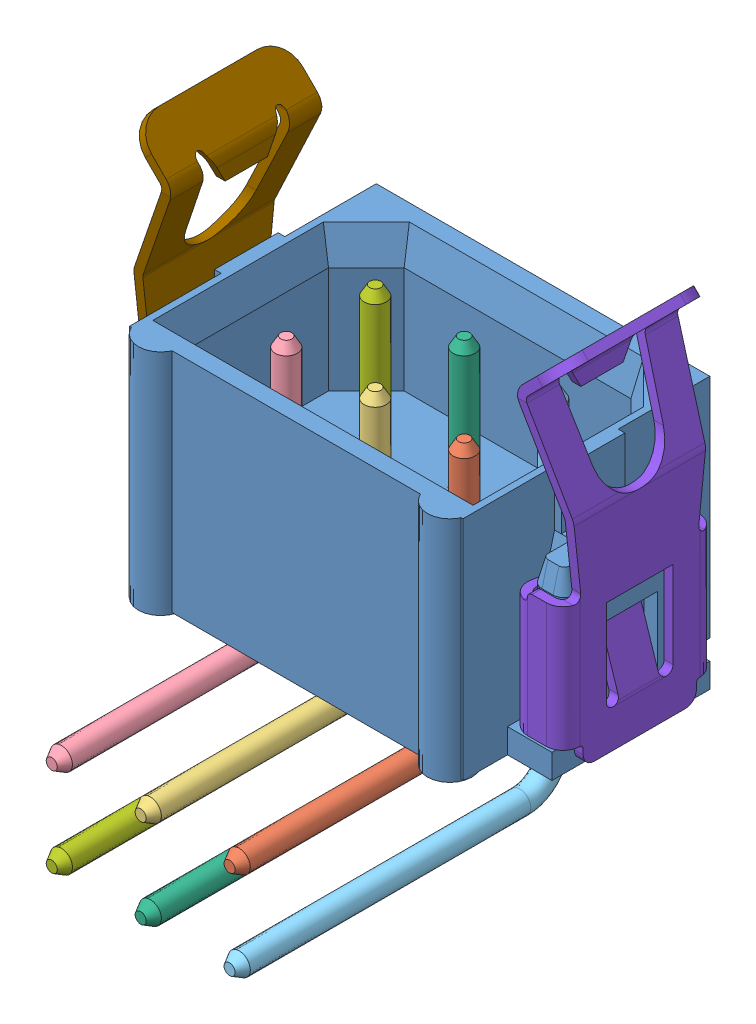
SolidWorks assembly m80-8510642_asm.SLDASM, configuration Default (file format 6000). Lengths in mm.
Overall size (9.9 11.1 9.05).
10 component instances, 9 part files, 0 mates.
Components (placement in the parent):
- M80-8680622-1: M80-8680622.sldasm [Default] at origin size (9.5 8.15 9.05)
  - M80-1020698_SEPARATE_ROWS-1: M80-1020698_SEPARATE_ROWS.sldprt [Default] at origin size (9.5 5.4 5.85)
  - M80-868-PIN1-1: M80-868-PIN1.sldprt [Default] at origin size (0.8 5.95 5.68)
  - M80-868-PIN1_1-1: M80-868-PIN1_1.sldprt [Default] at origin size (0.8 5.95 5.68)
  - M80-868-PIN1_2-1: M80-868-PIN1_2.sldprt [Default] at origin size (0.8 5.95 5.68)
  - M80-868-PIN2-1: M80-868-PIN2.sldprt [Default] at origin size (0.8 7.95 7.68)
  - M80-868-PIN2_1-1: M80-868-PIN2_1.sldprt [Default] at origin size (0.8 7.95 7.68)
  - M80-868-PIN2_2-1: M80-868-PIN2_2.sldprt [Default] at origin size (0.8 7.95 7.68)
- M80-001XXXX-1: M80-001XXXX.sldprt [Default] at origin size (1.2 7.95 3.45)
- M80-001XXXX_1-1: M80-001XXXX_1.sldprt [Default] at origin size (1.2 7.95 3.45)
